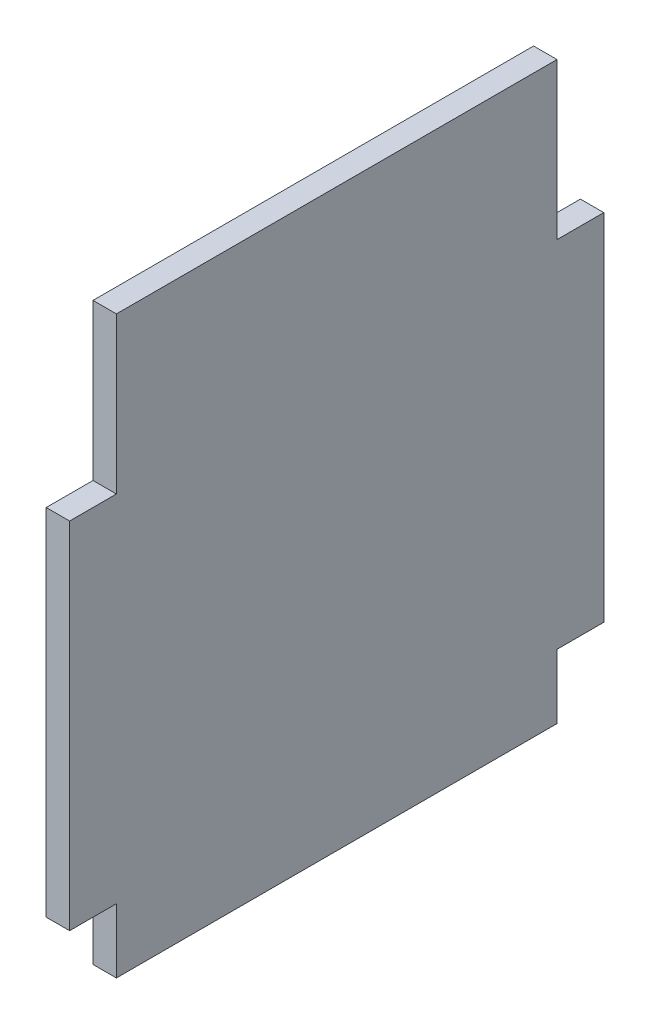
ISO-10303-21;
HEADER;
FILE_DESCRIPTION(('STEP AP214'),'2;1');
FILE_NAME('part.step','',(''),(''),'','','');
FILE_SCHEMA(('AUTOMOTIVE_DESIGN { 1 0 10303 214 1 1 1 1 }'));
ENDSEC;
DATA;
#1=APPLICATION_CONTEXT('core data for automotive mechanical design processes');
#2=APPLICATION_PROTOCOL_DEFINITION('international standard','automotive_design',2000,#1);
#3=PRODUCT_CONTEXT('',#1,'mechanical');
#4=PRODUCT('Part','Part','',(#3));
#5=PRODUCT_RELATED_PRODUCT_CATEGORY('part','',(#4));
#6=PRODUCT_DEFINITION_FORMATION('','',#4);
#7=PRODUCT_DEFINITION_CONTEXT('part definition',#1,'design');
#8=PRODUCT_DEFINITION('design','',#6,#7);
#9=PRODUCT_DEFINITION_SHAPE('','',#8);
#10=(LENGTH_UNIT() NAMED_UNIT(*) SI_UNIT(.MILLI.,.METRE.));
#11=(NAMED_UNIT(*) PLANE_ANGLE_UNIT() SI_UNIT($,.RADIAN.));
#12=(NAMED_UNIT(*) SI_UNIT($,.STERADIAN.) SOLID_ANGLE_UNIT());
#13=UNCERTAINTY_MEASURE_WITH_UNIT(LENGTH_MEASURE(1.E-05),#10,'distance_accuracy_value','');
#14=(GEOMETRIC_REPRESENTATION_CONTEXT(3) GLOBAL_UNCERTAINTY_ASSIGNED_CONTEXT((#13)) GLOBAL_UNIT_ASSIGNED_CONTEXT((#10,
#11,#12)) REPRESENTATION_CONTEXT('',''));
#15=CARTESIAN_POINT('',(0.,0.,0.));
#16=DIRECTION('',(0.,0.,1.));
#17=DIRECTION('',(1.,0.,0.));
#18=AXIS2_PLACEMENT_3D('',#15,#16,#17);
#19=CARTESIAN_POINT('',(6.,0.,0.));
#20=DIRECTION('',(1.,0.,0.));
#21=DIRECTION('',(0.,0.,-1.));
#22=AXIS2_PLACEMENT_3D('',#19,#20,#21);
#23=PLANE('',#22);
#24=DIRECTION('',(0.,0.,1.));
#25=VECTOR('',#24,1.);
#26=CARTESIAN_POINT('',(6.,-62.,56.5));
#27=LINE('',#26,#25);
#28=CARTESIAN_POINT('',(6.,-62.,-56.5));
#29=VERTEX_POINT('',#28);
#30=CARTESIAN_POINT('',(6.,-62.,56.5));
#31=VERTEX_POINT('',#30);
#32=EDGE_CURVE('E121',#29,#31,#27,.T.);
#33=ORIENTED_EDGE('',*,*,#32,.F.);
#34=DIRECTION('',(0.,-1.,0.));
#35=VECTOR('',#34,1.);
#36=CARTESIAN_POINT('',(6.,-85.5,-56.5));
#37=LINE('',#36,#35);
#38=CARTESIAN_POINT('',(6.,-45.5,-56.5));
#39=VERTEX_POINT('',#38);
#40=EDGE_CURVE('E131',#39,#29,#37,.T.);
#41=ORIENTED_EDGE('',*,*,#40,.F.);
#42=DIRECTION('',(0.,0.,1.));
#43=VECTOR('',#42,1.);
#44=CARTESIAN_POINT('',(6.,-45.5,-68.5));
#45=LINE('',#44,#43);
#46=CARTESIAN_POINT('',(6.,-45.5,-68.5));
#47=VERTEX_POINT('',#46);
#48=EDGE_CURVE('E141',#47,#39,#45,.T.);
#49=ORIENTED_EDGE('',*,*,#48,.F.);
#50=DIRECTION('',(0.,1.,0.));
#51=VECTOR('',#50,1.);
#52=CARTESIAN_POINT('',(6.,85.5,-68.5));
#53=LINE('',#52,#51);
#54=CARTESIAN_POINT('',(6.,45.5,-68.5));
#55=VERTEX_POINT('',#54);
#56=EDGE_CURVE('E187',#47,#55,#53,.T.);
#57=ORIENTED_EDGE('',*,*,#56,.T.);
#58=DIRECTION('',(0.,0.,1.));
#59=VECTOR('',#58,1.);
#60=CARTESIAN_POINT('',(6.,45.5,-68.5));
#61=LINE('',#60,#59);
#62=CARTESIAN_POINT('',(6.,45.5,-56.5));
#63=VERTEX_POINT('',#62);
#64=EDGE_CURVE('E240',#55,#63,#61,.T.);
#65=ORIENTED_EDGE('',*,*,#64,.T.);
#66=DIRECTION('',(0.,1.,0.));
#67=VECTOR('',#66,1.);
#68=CARTESIAN_POINT('',(6.,85.5,-56.5));
#69=LINE('',#68,#67);
#70=CARTESIAN_POINT('',(6.,85.5,-56.5));
#71=VERTEX_POINT('',#70);
#72=EDGE_CURVE('E241',#63,#71,#69,.T.);
#73=ORIENTED_EDGE('',*,*,#72,.T.);
#74=DIRECTION('',(0.,0.,1.));
#75=VECTOR('',#74,1.);
#76=CARTESIAN_POINT('',(6.,85.5,68.5));
#77=LINE('',#76,#75);
#78=CARTESIAN_POINT('',(6.,85.5,56.5));
#79=VERTEX_POINT('',#78);
#80=EDGE_CURVE('E190',#71,#79,#77,.T.);
#81=ORIENTED_EDGE('',*,*,#80,.T.);
#82=DIRECTION('',(0.,1.,0.));
#83=VECTOR('',#82,1.);
#84=CARTESIAN_POINT('',(6.,85.5,56.5));
#85=LINE('',#84,#83);
#86=CARTESIAN_POINT('',(6.,45.5,56.5));
#87=VERTEX_POINT('',#86);
#88=EDGE_CURVE('E172',#87,#79,#85,.T.);
#89=ORIENTED_EDGE('',*,*,#88,.F.);
#90=DIRECTION('',(0.,0.,-1.));
#91=VECTOR('',#90,1.);
#92=CARTESIAN_POINT('',(6.,45.5,68.5));
#93=LINE('',#92,#91);
#94=CARTESIAN_POINT('',(6.,45.5,68.5));
#95=VERTEX_POINT('',#94);
#96=EDGE_CURVE('E166',#95,#87,#93,.T.);
#97=ORIENTED_EDGE('',*,*,#96,.F.);
#98=DIRECTION('',(0.,-1.,0.));
#99=VECTOR('',#98,1.);
#100=CARTESIAN_POINT('',(6.,85.5,68.5));
#101=LINE('',#100,#99);
#102=CARTESIAN_POINT('',(6.,-45.5,68.5));
#103=VERTEX_POINT('',#102);
#104=EDGE_CURVE('E41',#95,#103,#101,.T.);
#105=ORIENTED_EDGE('',*,*,#104,.T.);
#106=DIRECTION('',(0.,0.,-1.));
#107=VECTOR('',#106,1.);
#108=CARTESIAN_POINT('',(6.,-45.5,68.5));
#109=LINE('',#108,#107);
#110=CARTESIAN_POINT('',(6.,-45.5,56.5));
#111=VERTEX_POINT('',#110);
#112=EDGE_CURVE('E157',#103,#111,#109,.T.);
#113=ORIENTED_EDGE('',*,*,#112,.T.);
#114=DIRECTION('',(0.,-1.,0.));
#115=VECTOR('',#114,1.);
#116=CARTESIAN_POINT('',(6.,-85.5,56.5));
#117=LINE('',#116,#115);
#118=EDGE_CURVE('E134',#111,#31,#117,.T.);
#119=ORIENTED_EDGE('',*,*,#118,.T.);
#120=EDGE_LOOP('',(#33,#41,#49,#57,#65,#73,#81,#89,#97,#105,#113,#119));
#121=FACE_BOUND('',#120,.T.);
#122=ADVANCED_FACE('F33',(#121),#23,.T.);
#123=CARTESIAN_POINT('',(0.,0.,0.));
#124=DIRECTION('',(1.,0.,0.));
#125=DIRECTION('',(0.,0.,-1.));
#126=AXIS2_PLACEMENT_3D('',#123,#124,#125);
#127=PLANE('',#126);
#128=DIRECTION('',(0.,-1.,0.));
#129=VECTOR('',#128,1.);
#130=CARTESIAN_POINT('',(0.,-85.5,-56.5));
#131=LINE('',#130,#129);
#132=CARTESIAN_POINT('',(0.,-45.5,-56.5));
#133=VERTEX_POINT('',#132);
#134=CARTESIAN_POINT('',(0.,-62.,-56.5));
#135=VERTEX_POINT('',#134);
#136=EDGE_CURVE('E144',#133,#135,#131,.T.);
#137=ORIENTED_EDGE('',*,*,#136,.T.);
#138=DIRECTION('',(0.,0.,1.));
#139=VECTOR('',#138,1.);
#140=CARTESIAN_POINT('',(0.,-62.,0.));
#141=LINE('',#140,#139);
#142=CARTESIAN_POINT('',(0.,-62.,56.5));
#143=VERTEX_POINT('',#142);
#144=EDGE_CURVE('E48',#135,#143,#141,.T.);
#145=ORIENTED_EDGE('',*,*,#144,.T.);
#146=DIRECTION('',(0.,-1.,0.));
#147=VECTOR('',#146,1.);
#148=CARTESIAN_POINT('',(0.,-85.5,56.5));
#149=LINE('',#148,#147);
#150=CARTESIAN_POINT('',(0.,-45.5,56.5));
#151=VERTEX_POINT('',#150);
#152=EDGE_CURVE('E153',#151,#143,#149,.T.);
#153=ORIENTED_EDGE('',*,*,#152,.F.);
#154=DIRECTION('',(0.,0.,-1.));
#155=VECTOR('',#154,1.);
#156=CARTESIAN_POINT('',(0.,-45.5,68.5));
#157=LINE('',#156,#155);
#158=CARTESIAN_POINT('',(0.,-45.5,68.5));
#159=VERTEX_POINT('',#158);
#160=EDGE_CURVE('E156',#159,#151,#157,.T.);
#161=ORIENTED_EDGE('',*,*,#160,.F.);
#162=DIRECTION('',(0.,-1.,0.));
#163=VECTOR('',#162,1.);
#164=CARTESIAN_POINT('',(0.,85.5,68.5));
#165=LINE('',#164,#163);
#166=CARTESIAN_POINT('',(0.,45.5,68.5));
#167=VERTEX_POINT('',#166);
#168=EDGE_CURVE('E191',#167,#159,#165,.T.);
#169=ORIENTED_EDGE('',*,*,#168,.F.);
#170=DIRECTION('',(0.,0.,-1.));
#171=VECTOR('',#170,1.);
#172=CARTESIAN_POINT('',(0.,45.5,68.5));
#173=LINE('',#172,#171);
#174=CARTESIAN_POINT('',(0.,45.5,56.5));
#175=VERTEX_POINT('',#174);
#176=EDGE_CURVE('E168',#167,#175,#173,.T.);
#177=ORIENTED_EDGE('',*,*,#176,.T.);
#178=DIRECTION('',(0.,1.,0.));
#179=VECTOR('',#178,1.);
#180=CARTESIAN_POINT('',(0.,85.5,56.5));
#181=LINE('',#180,#179);
#182=CARTESIAN_POINT('',(0.,85.5,56.5));
#183=VERTEX_POINT('',#182);
#184=EDGE_CURVE('E171',#175,#183,#181,.T.);
#185=ORIENTED_EDGE('',*,*,#184,.T.);
#186=DIRECTION('',(0.,0.,1.));
#187=VECTOR('',#186,1.);
#188=CARTESIAN_POINT('',(0.,85.5,68.5));
#189=LINE('',#188,#187);
#190=CARTESIAN_POINT('',(0.,85.5,-56.5));
#191=VERTEX_POINT('',#190);
#192=EDGE_CURVE('E197',#191,#183,#189,.T.);
#193=ORIENTED_EDGE('',*,*,#192,.F.);
#194=DIRECTION('',(0.,1.,0.));
#195=VECTOR('',#194,1.);
#196=CARTESIAN_POINT('',(0.,85.5,-56.5));
#197=LINE('',#196,#195);
#198=CARTESIAN_POINT('',(0.,45.5,-56.5));
#199=VERTEX_POINT('',#198);
#200=EDGE_CURVE('E55',#199,#191,#197,.T.);
#201=ORIENTED_EDGE('',*,*,#200,.F.);
#202=DIRECTION('',(0.,0.,1.));
#203=VECTOR('',#202,1.);
#204=CARTESIAN_POINT('',(0.,45.5,-68.5));
#205=LINE('',#204,#203);
#206=CARTESIAN_POINT('',(0.,45.5,-68.5));
#207=VERTEX_POINT('',#206);
#208=EDGE_CURVE('E227',#207,#199,#205,.T.);
#209=ORIENTED_EDGE('',*,*,#208,.F.);
#210=DIRECTION('',(0.,1.,0.));
#211=VECTOR('',#210,1.);
#212=CARTESIAN_POINT('',(0.,85.5,-68.5));
#213=LINE('',#212,#211);
#214=CARTESIAN_POINT('',(0.,-45.5,-68.5));
#215=VERTEX_POINT('',#214);
#216=EDGE_CURVE('E183',#215,#207,#213,.T.);
#217=ORIENTED_EDGE('',*,*,#216,.F.);
#218=DIRECTION('',(0.,0.,1.));
#219=VECTOR('',#218,1.);
#220=CARTESIAN_POINT('',(0.,-45.5,-68.5));
#221=LINE('',#220,#219);
#222=EDGE_CURVE('E140',#215,#133,#221,.T.);
#223=ORIENTED_EDGE('',*,*,#222,.T.);
#224=EDGE_LOOP('',(#137,#145,#153,#161,#169,#177,#185,#193,#201,#209,#217,#223));
#225=FACE_BOUND('',#224,.T.);
#226=ADVANCED_FACE('F206',(#225),#127,.F.);
#227=CARTESIAN_POINT('',(6.,85.5,-68.5));
#228=DIRECTION('',(0.,0.,1.));
#229=DIRECTION('',(0.,-1.,0.));
#230=AXIS2_PLACEMENT_3D('',#227,#228,#229);
#231=PLANE('',#230);
#232=DIRECTION('',(1.,0.,0.));
#233=VECTOR('',#232,1.);
#234=CARTESIAN_POINT('',(0.,45.5,-68.5));
#235=LINE('',#234,#233);
#236=EDGE_CURVE('E146',#207,#55,#235,.T.);
#237=ORIENTED_EDGE('',*,*,#236,.T.);
#238=ORIENTED_EDGE('',*,*,#56,.F.);
#239=DIRECTION('',(1.,0.,0.));
#240=VECTOR('',#239,1.);
#241=CARTESIAN_POINT('',(0.,-45.5,-68.5));
#242=LINE('',#241,#240);
#243=EDGE_CURVE('E151',#215,#47,#242,.T.);
#244=ORIENTED_EDGE('',*,*,#243,.F.);
#245=ORIENTED_EDGE('',*,*,#216,.T.);
#246=EDGE_LOOP('',(#237,#238,#244,#245));
#247=FACE_BOUND('',#246,.T.);
#248=ADVANCED_FACE('F35',(#247),#231,.F.);
#249=CARTESIAN_POINT('',(6.,85.5,68.5));
#250=DIRECTION('',(0.,-1.,0.));
#251=DIRECTION('',(0.,0.,-1.));
#252=AXIS2_PLACEMENT_3D('',#249,#250,#251);
#253=PLANE('',#252);
#254=DIRECTION('',(1.,0.,0.));
#255=VECTOR('',#254,1.);
#256=CARTESIAN_POINT('',(0.,85.5,-56.5));
#257=LINE('',#256,#255);
#258=EDGE_CURVE('E223',#191,#71,#257,.T.);
#259=ORIENTED_EDGE('',*,*,#258,.F.);
#260=ORIENTED_EDGE('',*,*,#192,.T.);
#261=DIRECTION('',(1.,0.,0.));
#262=VECTOR('',#261,1.);
#263=CARTESIAN_POINT('',(0.,85.5,56.5));
#264=LINE('',#263,#262);
#265=EDGE_CURVE('E180',#183,#79,#264,.T.);
#266=ORIENTED_EDGE('',*,*,#265,.T.);
#267=ORIENTED_EDGE('',*,*,#80,.F.);
#268=EDGE_LOOP('',(#259,#260,#266,#267));
#269=FACE_BOUND('',#268,.T.);
#270=ADVANCED_FACE('F221',(#269),#253,.F.);
#271=CARTESIAN_POINT('',(6.,85.5,68.5));
#272=DIRECTION('',(0.,0.,-1.));
#273=DIRECTION('',(0.,1.,0.));
#274=AXIS2_PLACEMENT_3D('',#271,#272,#273);
#275=PLANE('',#274);
#276=DIRECTION('',(1.,0.,0.));
#277=VECTOR('',#276,1.);
#278=CARTESIAN_POINT('',(0.,-45.5,68.5));
#279=LINE('',#278,#277);
#280=EDGE_CURVE('E163',#159,#103,#279,.T.);
#281=ORIENTED_EDGE('',*,*,#280,.T.);
#282=ORIENTED_EDGE('',*,*,#104,.F.);
#283=DIRECTION('',(1.,0.,0.));
#284=VECTOR('',#283,1.);
#285=CARTESIAN_POINT('',(0.,45.5,68.5));
#286=LINE('',#285,#284);
#287=EDGE_CURVE('E175',#167,#95,#286,.T.);
#288=ORIENTED_EDGE('',*,*,#287,.F.);
#289=ORIENTED_EDGE('',*,*,#168,.T.);
#290=EDGE_LOOP('',(#281,#282,#288,#289));
#291=FACE_BOUND('',#290,.T.);
#292=ADVANCED_FACE('F202',(#291),#275,.F.);
#293=CARTESIAN_POINT('',(0.,85.5,56.5));
#294=DIRECTION('',(0.,0.,-1.));
#295=DIRECTION('',(0.,1.,0.));
#296=AXIS2_PLACEMENT_3D('',#293,#294,#295);
#297=PLANE('',#296);
#298=ORIENTED_EDGE('',*,*,#88,.T.);
#299=ORIENTED_EDGE('',*,*,#265,.F.);
#300=ORIENTED_EDGE('',*,*,#184,.F.);
#301=DIRECTION('',(1.,0.,0.));
#302=VECTOR('',#301,1.);
#303=CARTESIAN_POINT('',(0.,45.5,56.5));
#304=LINE('',#303,#302);
#305=EDGE_CURVE('E184',#175,#87,#304,.T.);
#306=ORIENTED_EDGE('',*,*,#305,.T.);
#307=EDGE_LOOP('',(#298,#299,#300,#306));
#308=FACE_BOUND('',#307,.T.);
#309=ADVANCED_FACE('F216',(#308),#297,.F.);
#310=CARTESIAN_POINT('',(0.,45.5,68.5));
#311=DIRECTION('',(0.,-1.,0.));
#312=DIRECTION('',(0.,0.,-1.));
#313=AXIS2_PLACEMENT_3D('',#310,#311,#312);
#314=PLANE('',#313);
#315=ORIENTED_EDGE('',*,*,#96,.T.);
#316=ORIENTED_EDGE('',*,*,#305,.F.);
#317=ORIENTED_EDGE('',*,*,#176,.F.);
#318=ORIENTED_EDGE('',*,*,#287,.T.);
#319=EDGE_LOOP('',(#315,#316,#317,#318));
#320=FACE_BOUND('',#319,.T.);
#321=ADVANCED_FACE('F214',(#320),#314,.F.);
#322=CARTESIAN_POINT('',(0.,-45.5,68.5));
#323=DIRECTION('',(0.,-1.,0.));
#324=DIRECTION('',(0.,0.,-1.));
#325=AXIS2_PLACEMENT_3D('',#322,#323,#324);
#326=PLANE('',#325);
#327=ORIENTED_EDGE('',*,*,#112,.F.);
#328=ORIENTED_EDGE('',*,*,#280,.F.);
#329=ORIENTED_EDGE('',*,*,#160,.T.);
#330=DIRECTION('',(1.,0.,0.));
#331=VECTOR('',#330,1.);
#332=CARTESIAN_POINT('',(0.,-45.5,56.5));
#333=LINE('',#332,#331);
#334=EDGE_CURVE('E160',#151,#111,#333,.T.);
#335=ORIENTED_EDGE('',*,*,#334,.T.);
#336=EDGE_LOOP('',(#327,#328,#329,#335));
#337=FACE_BOUND('',#336,.T.);
#338=ADVANCED_FACE('F209',(#337),#326,.T.);
#339=CARTESIAN_POINT('',(0.,-85.5,56.5));
#340=DIRECTION('',(0.,0.,1.));
#341=DIRECTION('',(0.,-1.,0.));
#342=AXIS2_PLACEMENT_3D('',#339,#340,#341);
#343=PLANE('',#342);
#344=DIRECTION('',(1.,0.,0.));
#345=VECTOR('',#344,1.);
#346=CARTESIAN_POINT('',(-4.,-62.,56.5));
#347=LINE('',#346,#345);
#348=EDGE_CURVE('E135',#143,#31,#347,.T.);
#349=ORIENTED_EDGE('',*,*,#348,.T.);
#350=ORIENTED_EDGE('',*,*,#118,.F.);
#351=ORIENTED_EDGE('',*,*,#334,.F.);
#352=ORIENTED_EDGE('',*,*,#152,.T.);
#353=EDGE_LOOP('',(#349,#350,#351,#352));
#354=FACE_BOUND('',#353,.T.);
#355=ADVANCED_FACE('F249',(#354),#343,.T.);
#356=CARTESIAN_POINT('',(0.,-85.5,-56.5));
#357=DIRECTION('',(0.,0.,1.));
#358=DIRECTION('',(0.,-1.,0.));
#359=AXIS2_PLACEMENT_3D('',#356,#357,#358);
#360=PLANE('',#359);
#361=ORIENTED_EDGE('',*,*,#40,.T.);
#362=DIRECTION('',(-1.,0.,0.));
#363=VECTOR('',#362,1.);
#364=CARTESIAN_POINT('',(0.,-62.,-56.5));
#365=LINE('',#364,#363);
#366=EDGE_CURVE('E11',#29,#135,#365,.T.);
#367=ORIENTED_EDGE('',*,*,#366,.T.);
#368=ORIENTED_EDGE('',*,*,#136,.F.);
#369=DIRECTION('',(1.,0.,0.));
#370=VECTOR('',#369,1.);
#371=CARTESIAN_POINT('',(0.,-45.5,-56.5));
#372=LINE('',#371,#370);
#373=EDGE_CURVE('E138',#133,#39,#372,.T.);
#374=ORIENTED_EDGE('',*,*,#373,.T.);
#375=EDGE_LOOP('',(#361,#367,#368,#374));
#376=FACE_BOUND('',#375,.T.);
#377=ADVANCED_FACE('F137',(#376),#360,.F.);
#378=CARTESIAN_POINT('',(0.,-45.5,-68.5));
#379=DIRECTION('',(0.,1.,0.));
#380=DIRECTION('',(0.,0.,1.));
#381=AXIS2_PLACEMENT_3D('',#378,#379,#380);
#382=PLANE('',#381);
#383=ORIENTED_EDGE('',*,*,#48,.T.);
#384=ORIENTED_EDGE('',*,*,#373,.F.);
#385=ORIENTED_EDGE('',*,*,#222,.F.);
#386=ORIENTED_EDGE('',*,*,#243,.T.);
#387=EDGE_LOOP('',(#383,#384,#385,#386));
#388=FACE_BOUND('',#387,.T.);
#389=ADVANCED_FACE('F235',(#388),#382,.F.);
#390=CARTESIAN_POINT('',(0.,45.5,-68.5));
#391=DIRECTION('',(0.,1.,0.));
#392=DIRECTION('',(0.,0.,1.));
#393=AXIS2_PLACEMENT_3D('',#390,#391,#392);
#394=PLANE('',#393);
#395=ORIENTED_EDGE('',*,*,#64,.F.);
#396=ORIENTED_EDGE('',*,*,#236,.F.);
#397=ORIENTED_EDGE('',*,*,#208,.T.);
#398=DIRECTION('',(1.,0.,0.));
#399=VECTOR('',#398,1.);
#400=CARTESIAN_POINT('',(0.,45.5,-56.5));
#401=LINE('',#400,#399);
#402=EDGE_CURVE('E226',#199,#63,#401,.T.);
#403=ORIENTED_EDGE('',*,*,#402,.T.);
#404=EDGE_LOOP('',(#395,#396,#397,#403));
#405=FACE_BOUND('',#404,.T.);
#406=ADVANCED_FACE('F299',(#405),#394,.T.);
#407=CARTESIAN_POINT('',(0.,85.5,-56.5));
#408=DIRECTION('',(0.,0.,-1.));
#409=DIRECTION('',(0.,1.,0.));
#410=AXIS2_PLACEMENT_3D('',#407,#408,#409);
#411=PLANE('',#410);
#412=ORIENTED_EDGE('',*,*,#72,.F.);
#413=ORIENTED_EDGE('',*,*,#402,.F.);
#414=ORIENTED_EDGE('',*,*,#200,.T.);
#415=ORIENTED_EDGE('',*,*,#258,.T.);
#416=EDGE_LOOP('',(#412,#413,#414,#415));
#417=FACE_BOUND('',#416,.T.);
#418=ADVANCED_FACE('F307',(#417),#411,.T.);
#419=CARTESIAN_POINT('',(-4.,-62.,56.5));
#420=DIRECTION('',(0.,1.,0.));
#421=DIRECTION('',(0.,0.,1.));
#422=AXIS2_PLACEMENT_3D('',#419,#420,#421);
#423=PLANE('',#422);
#424=ORIENTED_EDGE('',*,*,#366,.F.);
#425=ORIENTED_EDGE('',*,*,#32,.T.);
#426=ORIENTED_EDGE('',*,*,#348,.F.);
#427=ORIENTED_EDGE('',*,*,#144,.F.);
#428=EDGE_LOOP('',(#424,#425,#426,#427));
#429=FACE_BOUND('',#428,.T.);
#430=ADVANCED_FACE('F120',(#429),#423,.F.);
#431=CLOSED_SHELL('',(#122,#226,#248,#270,#292,#309,#321,#338,#355,#377,#389,#406,#418,#430));
#432=MANIFOLD_SOLID_BREP('B2',#431);
#433=ADVANCED_BREP_SHAPE_REPRESENTATION('',(#18,#432),#14);
#434=SHAPE_DEFINITION_REPRESENTATION(#9,#433);
ENDSEC;
END-ISO-10303-21;
